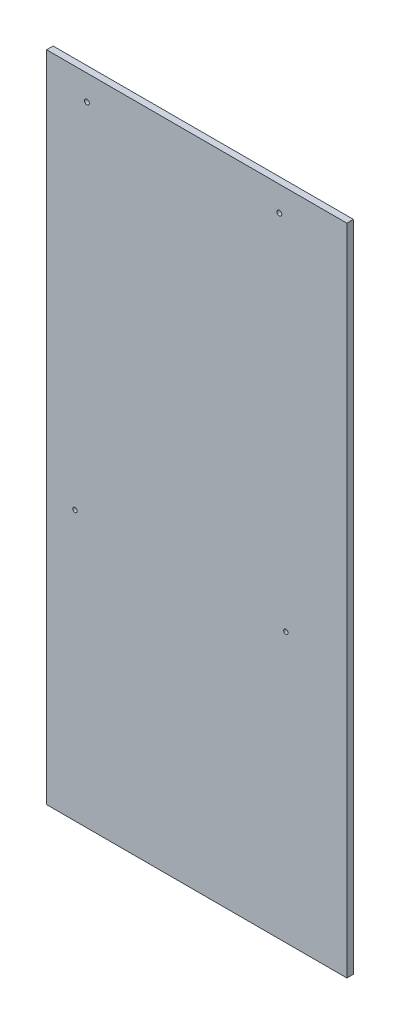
ISO-10303-21;
HEADER;
FILE_DESCRIPTION(('STEP AP214'),'2;1');
FILE_NAME('part.step','',(''),(''),'','','');
FILE_SCHEMA(('AUTOMOTIVE_DESIGN { 1 0 10303 214 1 1 1 1 }'));
ENDSEC;
DATA;
#1=APPLICATION_CONTEXT('core data for automotive mechanical design processes');
#2=APPLICATION_PROTOCOL_DEFINITION('international standard','automotive_design',2000,#1);
#3=PRODUCT_CONTEXT('',#1,'mechanical');
#4=PRODUCT('Part','Part','',(#3));
#5=PRODUCT_RELATED_PRODUCT_CATEGORY('part','',(#4));
#6=PRODUCT_DEFINITION_FORMATION('','',#4);
#7=PRODUCT_DEFINITION_CONTEXT('part definition',#1,'design');
#8=PRODUCT_DEFINITION('design','',#6,#7);
#9=PRODUCT_DEFINITION_SHAPE('','',#8);
#10=(LENGTH_UNIT() NAMED_UNIT(*) SI_UNIT(.MILLI.,.METRE.));
#11=(NAMED_UNIT(*) PLANE_ANGLE_UNIT() SI_UNIT($,.RADIAN.));
#12=(NAMED_UNIT(*) SI_UNIT($,.STERADIAN.) SOLID_ANGLE_UNIT());
#13=UNCERTAINTY_MEASURE_WITH_UNIT(LENGTH_MEASURE(1.E-05),#10,'distance_accuracy_value','');
#14=(GEOMETRIC_REPRESENTATION_CONTEXT(3) GLOBAL_UNCERTAINTY_ASSIGNED_CONTEXT((#13)) GLOBAL_UNIT_ASSIGNED_CONTEXT((#10,
#11,#12)) REPRESENTATION_CONTEXT('',''));
#15=CARTESIAN_POINT('',(0.,0.,0.));
#16=DIRECTION('',(0.,0.,1.));
#17=DIRECTION('',(1.,0.,0.));
#18=AXIS2_PLACEMENT_3D('',#15,#16,#17);
#19=CARTESIAN_POINT('',(175.006,-381.,7.62));
#20=DIRECTION('',(-1.,0.,0.));
#21=DIRECTION('',(0.,0.,1.));
#22=AXIS2_PLACEMENT_3D('',#19,#20,#21);
#23=PLANE('',#22);
#24=DIRECTION('',(0.,1.,0.));
#25=VECTOR('',#24,1.);
#26=CARTESIAN_POINT('',(175.006,-381.,0.));
#27=LINE('',#26,#25);
#28=CARTESIAN_POINT('',(175.006,-381.,0.));
#29=VERTEX_POINT('',#28);
#30=CARTESIAN_POINT('',(175.006,381.,0.));
#31=VERTEX_POINT('',#30);
#32=EDGE_CURVE('E107',#29,#31,#27,.T.);
#33=ORIENTED_EDGE('',*,*,#32,.T.);
#34=DIRECTION('',(0.,0.,-1.));
#35=VECTOR('',#34,1.);
#36=CARTESIAN_POINT('',(175.006,381.,7.62));
#37=LINE('',#36,#35);
#38=CARTESIAN_POINT('',(175.006,381.,7.62));
#39=VERTEX_POINT('',#38);
#40=EDGE_CURVE('E11',#39,#31,#37,.T.);
#41=ORIENTED_EDGE('',*,*,#40,.F.);
#42=DIRECTION('',(0.,1.,0.));
#43=VECTOR('',#42,1.);
#44=CARTESIAN_POINT('',(175.006,-381.,7.62));
#45=LINE('',#44,#43);
#46=CARTESIAN_POINT('',(175.006,-381.,7.62));
#47=VERTEX_POINT('',#46);
#48=EDGE_CURVE('E91',#47,#39,#45,.T.);
#49=ORIENTED_EDGE('',*,*,#48,.F.);
#50=DIRECTION('',(0.,0.,-1.));
#51=VECTOR('',#50,1.);
#52=CARTESIAN_POINT('',(175.006,-381.,7.62));
#53=LINE('',#52,#51);
#54=EDGE_CURVE('E103',#47,#29,#53,.T.);
#55=ORIENTED_EDGE('',*,*,#54,.T.);
#56=EDGE_LOOP('',(#33,#41,#49,#55));
#57=FACE_BOUND('',#56,.T.);
#58=ADVANCED_FACE('F39',(#57),#23,.F.);
#59=CARTESIAN_POINT('',(-175.006,381.,7.62));
#60=DIRECTION('',(0.,-1.,0.));
#61=DIRECTION('',(0.,0.,-1.));
#62=AXIS2_PLACEMENT_3D('',#59,#60,#61);
#63=PLANE('',#62);
#64=DIRECTION('',(-1.,0.,0.));
#65=VECTOR('',#64,1.);
#66=CARTESIAN_POINT('',(-175.006,381.,0.));
#67=LINE('',#66,#65);
#68=CARTESIAN_POINT('',(-175.006,381.,0.));
#69=VERTEX_POINT('',#68);
#70=EDGE_CURVE('E96',#31,#69,#67,.T.);
#71=ORIENTED_EDGE('',*,*,#70,.T.);
#72=DIRECTION('',(0.,0.,-1.));
#73=VECTOR('',#72,1.);
#74=CARTESIAN_POINT('',(-175.006,381.,7.62));
#75=LINE('',#74,#73);
#76=CARTESIAN_POINT('',(-175.006,381.,7.62));
#77=VERTEX_POINT('',#76);
#78=EDGE_CURVE('E48',#77,#69,#75,.T.);
#79=ORIENTED_EDGE('',*,*,#78,.F.);
#80=DIRECTION('',(-1.,0.,0.));
#81=VECTOR('',#80,1.);
#82=CARTESIAN_POINT('',(-175.006,381.,7.62));
#83=LINE('',#82,#81);
#84=EDGE_CURVE('E86',#39,#77,#83,.T.);
#85=ORIENTED_EDGE('',*,*,#84,.F.);
#86=ORIENTED_EDGE('',*,*,#40,.T.);
#87=EDGE_LOOP('',(#71,#79,#85,#86));
#88=FACE_BOUND('',#87,.T.);
#89=ADVANCED_FACE('F95',(#88),#63,.F.);
#90=CARTESIAN_POINT('',(-175.006,-381.,7.62));
#91=DIRECTION('',(1.,0.,0.));
#92=DIRECTION('',(0.,0.,-1.));
#93=AXIS2_PLACEMENT_3D('',#90,#91,#92);
#94=PLANE('',#93);
#95=DIRECTION('',(0.,-1.,0.));
#96=VECTOR('',#95,1.);
#97=CARTESIAN_POINT('',(-175.006,-381.,0.));
#98=LINE('',#97,#96);
#99=CARTESIAN_POINT('',(-175.006,-381.,0.));
#100=VERTEX_POINT('',#99);
#101=EDGE_CURVE('E73',#69,#100,#98,.T.);
#102=ORIENTED_EDGE('',*,*,#101,.T.);
#103=DIRECTION('',(0.,0.,-1.));
#104=VECTOR('',#103,1.);
#105=CARTESIAN_POINT('',(-175.006,-381.,7.62));
#106=LINE('',#105,#104);
#107=CARTESIAN_POINT('',(-175.006,-381.,7.62));
#108=VERTEX_POINT('',#107);
#109=EDGE_CURVE('E98',#108,#100,#106,.T.);
#110=ORIENTED_EDGE('',*,*,#109,.F.);
#111=DIRECTION('',(0.,-1.,0.));
#112=VECTOR('',#111,1.);
#113=CARTESIAN_POINT('',(-175.006,-381.,7.62));
#114=LINE('',#113,#112);
#115=EDGE_CURVE('E89',#77,#108,#114,.T.);
#116=ORIENTED_EDGE('',*,*,#115,.F.);
#117=ORIENTED_EDGE('',*,*,#78,.T.);
#118=EDGE_LOOP('',(#102,#110,#116,#117));
#119=FACE_BOUND('',#118,.T.);
#120=ADVANCED_FACE('F99',(#119),#94,.F.);
#121=CARTESIAN_POINT('',(-175.006,-381.,7.62));
#122=DIRECTION('',(0.,1.,0.));
#123=DIRECTION('',(0.,0.,1.));
#124=AXIS2_PLACEMENT_3D('',#121,#122,#123);
#125=PLANE('',#124);
#126=DIRECTION('',(1.,0.,0.));
#127=VECTOR('',#126,1.);
#128=CARTESIAN_POINT('',(-175.006,-381.,0.));
#129=LINE('',#128,#127);
#130=EDGE_CURVE('E79',#100,#29,#129,.T.);
#131=ORIENTED_EDGE('',*,*,#130,.T.);
#132=ORIENTED_EDGE('',*,*,#54,.F.);
#133=DIRECTION('',(1.,0.,0.));
#134=VECTOR('',#133,1.);
#135=CARTESIAN_POINT('',(-175.006,-381.,7.62));
#136=LINE('',#135,#134);
#137=EDGE_CURVE('E56',#108,#47,#136,.T.);
#138=ORIENTED_EDGE('',*,*,#137,.F.);
#139=ORIENTED_EDGE('',*,*,#109,.T.);
#140=EDGE_LOOP('',(#131,#132,#138,#139));
#141=FACE_BOUND('',#140,.T.);
#142=ADVANCED_FACE('F121',(#141),#125,.F.);
#143=CARTESIAN_POINT('',(0.,0.,7.62));
#144=DIRECTION('',(0.,0.,-1.));
#145=DIRECTION('',(-1.,0.,0.));
#146=AXIS2_PLACEMENT_3D('',#143,#144,#145);
#147=PLANE('',#146);
#148=CARTESIAN_POINT('',(103.886,-67.056,7.62));
#149=DIRECTION('',(0.,0.,1.));
#150=DIRECTION('',(1.,0.,0.));
#151=AXIS2_PLACEMENT_3D('',#148,#149,#150);
#152=CIRCLE('',#151,2.53999999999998);
#153=CARTESIAN_POINT('',(106.426,-67.056,7.62));
#154=VERTEX_POINT('',#153);
#155=EDGE_CURVE('E152',#154,#154,#152,.T.);
#156=ORIENTED_EDGE('',*,*,#155,.F.);
#157=EDGE_LOOP('',(#156));
#158=FACE_BOUND('',#157,.T.);
#159=CARTESIAN_POINT('',(-141.986,-67.056,7.62));
#160=DIRECTION('',(0.,0.,1.));
#161=DIRECTION('',(1.,0.,0.));
#162=AXIS2_PLACEMENT_3D('',#159,#160,#161);
#163=CIRCLE('',#162,2.53999999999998);
#164=CARTESIAN_POINT('',(-139.446,-67.056,7.62));
#165=VERTEX_POINT('',#164);
#166=EDGE_CURVE('E144',#165,#165,#163,.T.);
#167=ORIENTED_EDGE('',*,*,#166,.F.);
#168=EDGE_LOOP('',(#167));
#169=FACE_BOUND('',#168,.T.);
#170=CARTESIAN_POINT('',(-128.016,351.79,7.62));
#171=DIRECTION('',(0.,0.,1.));
#172=DIRECTION('',(1.,0.,0.));
#173=AXIS2_PLACEMENT_3D('',#170,#171,#172);
#174=CIRCLE('',#173,2.85750000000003);
#175=CARTESIAN_POINT('',(-125.1585,351.79,7.62));
#176=VERTEX_POINT('',#175);
#177=EDGE_CURVE('E137',#176,#176,#174,.T.);
#178=ORIENTED_EDGE('',*,*,#177,.F.);
#179=EDGE_LOOP('',(#178));
#180=FACE_BOUND('',#179,.T.);
#181=CARTESIAN_POINT('',(96.266,351.79,7.62));
#182=DIRECTION('',(0.,0.,1.));
#183=DIRECTION('',(1.,0.,0.));
#184=AXIS2_PLACEMENT_3D('',#181,#182,#183);
#185=CIRCLE('',#184,2.85750000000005);
#186=CARTESIAN_POINT('',(99.1235,351.79,7.62));
#187=VERTEX_POINT('',#186);
#188=EDGE_CURVE('E128',#187,#187,#185,.T.);
#189=ORIENTED_EDGE('',*,*,#188,.F.);
#190=EDGE_LOOP('',(#189));
#191=FACE_BOUND('',#190,.T.);
#192=ORIENTED_EDGE('',*,*,#48,.T.);
#193=ORIENTED_EDGE('',*,*,#84,.T.);
#194=ORIENTED_EDGE('',*,*,#115,.T.);
#195=ORIENTED_EDGE('',*,*,#137,.T.);
#196=EDGE_LOOP('',(#192,#193,#194,#195));
#197=FACE_BOUND('',#196,.T.);
#198=ADVANCED_FACE('F87',(#158,#169,#180,#191,#197),#147,.F.);
#199=CARTESIAN_POINT('',(0.,0.,0.));
#200=DIRECTION('',(0.,0.,-1.));
#201=DIRECTION('',(-1.,0.,0.));
#202=AXIS2_PLACEMENT_3D('',#199,#200,#201);
#203=PLANE('',#202);
#204=CARTESIAN_POINT('',(103.886,-67.056,0.));
#205=DIRECTION('',(0.,0.,1.));
#206=DIRECTION('',(1.,0.,0.));
#207=AXIS2_PLACEMENT_3D('',#204,#205,#206);
#208=CIRCLE('',#207,2.53999999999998);
#209=CARTESIAN_POINT('',(106.426,-67.056,0.));
#210=VERTEX_POINT('',#209);
#211=EDGE_CURVE('E148',#210,#210,#208,.T.);
#212=ORIENTED_EDGE('',*,*,#211,.T.);
#213=EDGE_LOOP('',(#212));
#214=FACE_BOUND('',#213,.T.);
#215=CARTESIAN_POINT('',(-141.986,-67.056,0.));
#216=DIRECTION('',(0.,0.,1.));
#217=DIRECTION('',(1.,0.,0.));
#218=AXIS2_PLACEMENT_3D('',#215,#216,#217);
#219=CIRCLE('',#218,2.53999999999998);
#220=CARTESIAN_POINT('',(-139.446,-67.056,0.));
#221=VERTEX_POINT('',#220);
#222=EDGE_CURVE('E133',#221,#221,#219,.T.);
#223=ORIENTED_EDGE('',*,*,#222,.T.);
#224=EDGE_LOOP('',(#223));
#225=FACE_BOUND('',#224,.T.);
#226=CARTESIAN_POINT('',(-128.016,351.79,0.));
#227=DIRECTION('',(0.,0.,1.));
#228=DIRECTION('',(1.,0.,0.));
#229=AXIS2_PLACEMENT_3D('',#226,#227,#228);
#230=CIRCLE('',#229,2.85750000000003);
#231=CARTESIAN_POINT('',(-125.1585,351.79,0.));
#232=VERTEX_POINT('',#231);
#233=EDGE_CURVE('E111',#232,#232,#230,.T.);
#234=ORIENTED_EDGE('',*,*,#233,.T.);
#235=EDGE_LOOP('',(#234));
#236=FACE_BOUND('',#235,.T.);
#237=CARTESIAN_POINT('',(96.266,351.79,0.));
#238=DIRECTION('',(0.,0.,1.));
#239=DIRECTION('',(1.,0.,0.));
#240=AXIS2_PLACEMENT_3D('',#237,#238,#239);
#241=CIRCLE('',#240,2.85750000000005);
#242=CARTESIAN_POINT('',(99.1235,351.79,0.));
#243=VERTEX_POINT('',#242);
#244=EDGE_CURVE('E132',#243,#243,#241,.T.);
#245=ORIENTED_EDGE('',*,*,#244,.T.);
#246=EDGE_LOOP('',(#245));
#247=FACE_BOUND('',#246,.T.);
#248=ORIENTED_EDGE('',*,*,#32,.F.);
#249=ORIENTED_EDGE('',*,*,#130,.F.);
#250=ORIENTED_EDGE('',*,*,#101,.F.);
#251=ORIENTED_EDGE('',*,*,#70,.F.);
#252=EDGE_LOOP('',(#248,#249,#250,#251));
#253=FACE_BOUND('',#252,.T.);
#254=ADVANCED_FACE('F124',(#214,#225,#236,#247,#253),#203,.T.);
#255=CARTESIAN_POINT('',(96.266,351.79,0.));
#256=DIRECTION('',(0.,0.,1.));
#257=DIRECTION('',(1.,0.,0.));
#258=AXIS2_PLACEMENT_3D('',#255,#256,#257);
#259=CYLINDRICAL_SURFACE('',#258,2.85750000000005);
#260=CARTESIAN_POINT('',(99.1235,351.79,0.));
#261=CARTESIAN_POINT('',(99.1235,351.79,0.0793749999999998));
#262=CARTESIAN_POINT('',(99.1235,351.79,0.15875));
#263=CARTESIAN_POINT('',(99.1235,351.79,0.3175));
#264=CARTESIAN_POINT('',(99.1235,351.79,0.396875));
#265=CARTESIAN_POINT('',(99.1235,351.79,0.555625));
#266=CARTESIAN_POINT('',(99.1235,351.79,0.635));
#267=CARTESIAN_POINT('',(99.1235,351.79,0.79375));
#268=CARTESIAN_POINT('',(99.1235,351.79,0.873125));
#269=CARTESIAN_POINT('',(99.1235,351.79,1.031875));
#270=CARTESIAN_POINT('',(99.1235,351.79,1.11125));
#271=CARTESIAN_POINT('',(99.1235,351.79,1.27));
#272=CARTESIAN_POINT('',(99.1235,351.79,1.349375));
#273=CARTESIAN_POINT('',(99.1235,351.79,1.508125));
#274=CARTESIAN_POINT('',(99.1235,351.79,1.5875));
#275=CARTESIAN_POINT('',(99.1235,351.79,1.74625));
#276=CARTESIAN_POINT('',(99.1235,351.79,1.825625));
#277=CARTESIAN_POINT('',(99.1235,351.79,1.984375));
#278=CARTESIAN_POINT('',(99.1235,351.79,2.06375));
#279=CARTESIAN_POINT('',(99.1235,351.79,2.2225));
#280=CARTESIAN_POINT('',(99.1235,351.79,2.301875));
#281=CARTESIAN_POINT('',(99.1235,351.79,2.460625));
#282=CARTESIAN_POINT('',(99.1235,351.79,2.54));
#283=CARTESIAN_POINT('',(99.1235,351.79,2.69875));
#284=CARTESIAN_POINT('',(99.1235,351.79,2.778125));
#285=CARTESIAN_POINT('',(99.1235,351.79,2.936875));
#286=CARTESIAN_POINT('',(99.1235,351.79,3.01625));
#287=CARTESIAN_POINT('',(99.1235,351.79,3.175));
#288=CARTESIAN_POINT('',(99.1235,351.79,3.254375));
#289=CARTESIAN_POINT('',(99.1235,351.79,3.413125));
#290=CARTESIAN_POINT('',(99.1235,351.79,3.4925));
#291=CARTESIAN_POINT('',(99.1235,351.79,3.65125));
#292=CARTESIAN_POINT('',(99.1235,351.79,3.730625));
#293=CARTESIAN_POINT('',(99.1235,351.79,3.889375));
#294=CARTESIAN_POINT('',(99.1235,351.79,3.96875));
#295=CARTESIAN_POINT('',(99.1235,351.79,4.1275));
#296=CARTESIAN_POINT('',(99.1235,351.79,4.206875));
#297=CARTESIAN_POINT('',(99.1235,351.79,4.365625));
#298=CARTESIAN_POINT('',(99.1235,351.79,4.445));
#299=CARTESIAN_POINT('',(99.1235,351.79,4.60375));
#300=CARTESIAN_POINT('',(99.1235,351.79,4.683125));
#301=CARTESIAN_POINT('',(99.1235,351.79,4.841875));
#302=CARTESIAN_POINT('',(99.1235,351.79,4.92125));
#303=CARTESIAN_POINT('',(99.1235,351.79,5.08));
#304=CARTESIAN_POINT('',(99.1235,351.79,5.159375));
#305=CARTESIAN_POINT('',(99.1235,351.79,5.318125));
#306=CARTESIAN_POINT('',(99.1235,351.79,5.3975));
#307=CARTESIAN_POINT('',(99.1235,351.79,5.55625));
#308=CARTESIAN_POINT('',(99.1235,351.79,5.635625));
#309=CARTESIAN_POINT('',(99.1235,351.79,5.794375));
#310=CARTESIAN_POINT('',(99.1235,351.79,5.87375));
#311=CARTESIAN_POINT('',(99.1235,351.79,6.0325));
#312=CARTESIAN_POINT('',(99.1235,351.79,6.111875));
#313=CARTESIAN_POINT('',(99.1235,351.79,6.270625));
#314=CARTESIAN_POINT('',(99.1235,351.79,6.35));
#315=CARTESIAN_POINT('',(99.1235,351.79,6.50875));
#316=CARTESIAN_POINT('',(99.1235,351.79,6.588125));
#317=CARTESIAN_POINT('',(99.1235,351.79,6.746875));
#318=CARTESIAN_POINT('',(99.1235,351.79,6.82625));
#319=CARTESIAN_POINT('',(99.1235,351.79,6.985));
#320=CARTESIAN_POINT('',(99.1235,351.79,7.064375));
#321=CARTESIAN_POINT('',(99.1235,351.79,7.223125));
#322=CARTESIAN_POINT('',(99.1235,351.79,7.3025));
#323=CARTESIAN_POINT('',(99.1235,351.79,7.46125));
#324=CARTESIAN_POINT('',(99.1235,351.79,7.540625));
#325=CARTESIAN_POINT('',(99.1235,351.79,7.62));
#326=B_SPLINE_CURVE_WITH_KNOTS('',3,(#260,#261,#262,#263,#264,#265,#266,#267,#268,#269,#270,
#271,#272,#273,#274,#275,#276,#277,#278,#279,#280,#281,#282,#283,#284,#285,#286,#287,#288,#289,
#290,#291,#292,#293,#294,#295,#296,#297,#298,#299,#300,#301,#302,#303,#304,#305,#306,#307,#308,
#309,#310,#311,#312,#313,#314,#315,#316,#317,#318,#319,#320,#321,#322,#323,#324,#325),
.UNSPECIFIED.,.F.,.F.,(4,2,2,2,2,2,2,2,2,2,2,2,2,2,2,2,2,2,2,2,2,2,2,2,2,2,2,2,2,2,2,2,4),(0.,
0.238125,0.47625,0.714375,0.9525,1.190625,1.42875,1.666875,1.905,2.143125,2.38125,2.619375,
2.8575,3.095625,3.33375,3.571875,3.81,4.048125,4.28625,4.524375,4.7625,5.000625,5.23875,
5.476875,5.715,5.953125,6.19125,6.429375,6.6675,6.905625,7.14375,7.381875,7.62),.UNSPECIFIED.);
#327=EDGE_CURVE('BSEAM178',#243,#187,#326,.T.);
#328=ORIENTED_EDGE('',*,*,#244,.F.);
#329=ORIENTED_EDGE('',*,*,#188,.T.);
#330=ORIENTED_EDGE('',*,*,#327,.T.);
#331=ORIENTED_EDGE('',*,*,#327,.F.);
#332=EDGE_LOOP('',(#328,#330,#329,#331));
#333=FACE_BOUND('',#332,.T.);
#334=ADVANCED_FACE('F178',(#333),#259,.F.);
#335=CARTESIAN_POINT('',(-128.016,351.79,0.));
#336=DIRECTION('',(0.,0.,1.));
#337=DIRECTION('',(1.,0.,0.));
#338=AXIS2_PLACEMENT_3D('',#335,#336,#337);
#339=CYLINDRICAL_SURFACE('',#338,2.85750000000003);
#340=CARTESIAN_POINT('',(-125.1585,351.79,0.));
#341=CARTESIAN_POINT('',(-125.1585,351.79,0.0793749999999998));
#342=CARTESIAN_POINT('',(-125.1585,351.79,0.15875));
#343=CARTESIAN_POINT('',(-125.1585,351.79,0.3175));
#344=CARTESIAN_POINT('',(-125.1585,351.79,0.396875));
#345=CARTESIAN_POINT('',(-125.1585,351.79,0.555625));
#346=CARTESIAN_POINT('',(-125.1585,351.79,0.635));
#347=CARTESIAN_POINT('',(-125.1585,351.79,0.79375));
#348=CARTESIAN_POINT('',(-125.1585,351.79,0.873125));
#349=CARTESIAN_POINT('',(-125.1585,351.79,1.031875));
#350=CARTESIAN_POINT('',(-125.1585,351.79,1.11125));
#351=CARTESIAN_POINT('',(-125.1585,351.79,1.27));
#352=CARTESIAN_POINT('',(-125.1585,351.79,1.349375));
#353=CARTESIAN_POINT('',(-125.1585,351.79,1.508125));
#354=CARTESIAN_POINT('',(-125.1585,351.79,1.5875));
#355=CARTESIAN_POINT('',(-125.1585,351.79,1.74625));
#356=CARTESIAN_POINT('',(-125.1585,351.79,1.825625));
#357=CARTESIAN_POINT('',(-125.1585,351.79,1.984375));
#358=CARTESIAN_POINT('',(-125.1585,351.79,2.06375));
#359=CARTESIAN_POINT('',(-125.1585,351.79,2.2225));
#360=CARTESIAN_POINT('',(-125.1585,351.79,2.301875));
#361=CARTESIAN_POINT('',(-125.1585,351.79,2.460625));
#362=CARTESIAN_POINT('',(-125.1585,351.79,2.54));
#363=CARTESIAN_POINT('',(-125.1585,351.79,2.69875));
#364=CARTESIAN_POINT('',(-125.1585,351.79,2.778125));
#365=CARTESIAN_POINT('',(-125.1585,351.79,2.936875));
#366=CARTESIAN_POINT('',(-125.1585,351.79,3.01625));
#367=CARTESIAN_POINT('',(-125.1585,351.79,3.175));
#368=CARTESIAN_POINT('',(-125.1585,351.79,3.254375));
#369=CARTESIAN_POINT('',(-125.1585,351.79,3.413125));
#370=CARTESIAN_POINT('',(-125.1585,351.79,3.4925));
#371=CARTESIAN_POINT('',(-125.1585,351.79,3.65125));
#372=CARTESIAN_POINT('',(-125.1585,351.79,3.730625));
#373=CARTESIAN_POINT('',(-125.1585,351.79,3.889375));
#374=CARTESIAN_POINT('',(-125.1585,351.79,3.96875));
#375=CARTESIAN_POINT('',(-125.1585,351.79,4.1275));
#376=CARTESIAN_POINT('',(-125.1585,351.79,4.206875));
#377=CARTESIAN_POINT('',(-125.1585,351.79,4.365625));
#378=CARTESIAN_POINT('',(-125.1585,351.79,4.445));
#379=CARTESIAN_POINT('',(-125.1585,351.79,4.60375));
#380=CARTESIAN_POINT('',(-125.1585,351.79,4.683125));
#381=CARTESIAN_POINT('',(-125.1585,351.79,4.841875));
#382=CARTESIAN_POINT('',(-125.1585,351.79,4.92125));
#383=CARTESIAN_POINT('',(-125.1585,351.79,5.08));
#384=CARTESIAN_POINT('',(-125.1585,351.79,5.159375));
#385=CARTESIAN_POINT('',(-125.1585,351.79,5.318125));
#386=CARTESIAN_POINT('',(-125.1585,351.79,5.3975));
#387=CARTESIAN_POINT('',(-125.1585,351.79,5.55625));
#388=CARTESIAN_POINT('',(-125.1585,351.79,5.635625));
#389=CARTESIAN_POINT('',(-125.1585,351.79,5.794375));
#390=CARTESIAN_POINT('',(-125.1585,351.79,5.87375));
#391=CARTESIAN_POINT('',(-125.1585,351.79,6.0325));
#392=CARTESIAN_POINT('',(-125.1585,351.79,6.111875));
#393=CARTESIAN_POINT('',(-125.1585,351.79,6.270625));
#394=CARTESIAN_POINT('',(-125.1585,351.79,6.35));
#395=CARTESIAN_POINT('',(-125.1585,351.79,6.50875));
#396=CARTESIAN_POINT('',(-125.1585,351.79,6.588125));
#397=CARTESIAN_POINT('',(-125.1585,351.79,6.746875));
#398=CARTESIAN_POINT('',(-125.1585,351.79,6.82625));
#399=CARTESIAN_POINT('',(-125.1585,351.79,6.985));
#400=CARTESIAN_POINT('',(-125.1585,351.79,7.064375));
#401=CARTESIAN_POINT('',(-125.1585,351.79,7.223125));
#402=CARTESIAN_POINT('',(-125.1585,351.79,7.3025));
#403=CARTESIAN_POINT('',(-125.1585,351.79,7.46125));
#404=CARTESIAN_POINT('',(-125.1585,351.79,7.540625));
#405=CARTESIAN_POINT('',(-125.1585,351.79,7.62));
#406=B_SPLINE_CURVE_WITH_KNOTS('',3,(#340,#341,#342,#343,#344,#345,#346,#347,#348,#349,#350,
#351,#352,#353,#354,#355,#356,#357,#358,#359,#360,#361,#362,#363,#364,#365,#366,#367,#368,#369,
#370,#371,#372,#373,#374,#375,#376,#377,#378,#379,#380,#381,#382,#383,#384,#385,#386,#387,#388,
#389,#390,#391,#392,#393,#394,#395,#396,#397,#398,#399,#400,#401,#402,#403,#404,#405),
.UNSPECIFIED.,.F.,.F.,(4,2,2,2,2,2,2,2,2,2,2,2,2,2,2,2,2,2,2,2,2,2,2,2,2,2,2,2,2,2,2,2,4),(0.,
0.238125,0.47625,0.714375,0.9525,1.190625,1.42875,1.666875,1.905,2.143125,2.38125,2.619375,
2.8575,3.095625,3.33375,3.571875,3.81,4.048125,4.28625,4.524375,4.7625,5.000625,5.23875,
5.476875,5.715,5.953125,6.19125,6.429375,6.6675,6.905625,7.14375,7.381875,7.62),.UNSPECIFIED.);
#407=EDGE_CURVE('BSEAM180',#232,#176,#406,.T.);
#408=ORIENTED_EDGE('',*,*,#233,.F.);
#409=ORIENTED_EDGE('',*,*,#177,.T.);
#410=ORIENTED_EDGE('',*,*,#407,.T.);
#411=ORIENTED_EDGE('',*,*,#407,.F.);
#412=EDGE_LOOP('',(#408,#410,#409,#411));
#413=FACE_BOUND('',#412,.T.);
#414=ADVANCED_FACE('F180',(#413),#339,.F.);
#415=CARTESIAN_POINT('',(-141.986,-67.056,0.));
#416=DIRECTION('',(0.,0.,1.));
#417=DIRECTION('',(1.,0.,0.));
#418=AXIS2_PLACEMENT_3D('',#415,#416,#417);
#419=CYLINDRICAL_SURFACE('',#418,2.53999999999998);
#420=CARTESIAN_POINT('',(-139.446,-67.056,0.));
#421=CARTESIAN_POINT('',(-139.446,-67.056,0.0793749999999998));
#422=CARTESIAN_POINT('',(-139.446,-67.056,0.15875));
#423=CARTESIAN_POINT('',(-139.446,-67.056,0.3175));
#424=CARTESIAN_POINT('',(-139.446,-67.056,0.396875));
#425=CARTESIAN_POINT('',(-139.446,-67.056,0.555625));
#426=CARTESIAN_POINT('',(-139.446,-67.056,0.635));
#427=CARTESIAN_POINT('',(-139.446,-67.056,0.79375));
#428=CARTESIAN_POINT('',(-139.446,-67.056,0.873125));
#429=CARTESIAN_POINT('',(-139.446,-67.056,1.031875));
#430=CARTESIAN_POINT('',(-139.446,-67.056,1.11125));
#431=CARTESIAN_POINT('',(-139.446,-67.056,1.27));
#432=CARTESIAN_POINT('',(-139.446,-67.056,1.349375));
#433=CARTESIAN_POINT('',(-139.446,-67.056,1.508125));
#434=CARTESIAN_POINT('',(-139.446,-67.056,1.5875));
#435=CARTESIAN_POINT('',(-139.446,-67.056,1.74625));
#436=CARTESIAN_POINT('',(-139.446,-67.056,1.825625));
#437=CARTESIAN_POINT('',(-139.446,-67.056,1.984375));
#438=CARTESIAN_POINT('',(-139.446,-67.056,2.06375));
#439=CARTESIAN_POINT('',(-139.446,-67.056,2.2225));
#440=CARTESIAN_POINT('',(-139.446,-67.056,2.301875));
#441=CARTESIAN_POINT('',(-139.446,-67.056,2.460625));
#442=CARTESIAN_POINT('',(-139.446,-67.056,2.54));
#443=CARTESIAN_POINT('',(-139.446,-67.056,2.69875));
#444=CARTESIAN_POINT('',(-139.446,-67.056,2.778125));
#445=CARTESIAN_POINT('',(-139.446,-67.056,2.936875));
#446=CARTESIAN_POINT('',(-139.446,-67.056,3.01625));
#447=CARTESIAN_POINT('',(-139.446,-67.056,3.175));
#448=CARTESIAN_POINT('',(-139.446,-67.056,3.254375));
#449=CARTESIAN_POINT('',(-139.446,-67.056,3.413125));
#450=CARTESIAN_POINT('',(-139.446,-67.056,3.4925));
#451=CARTESIAN_POINT('',(-139.446,-67.056,3.65125));
#452=CARTESIAN_POINT('',(-139.446,-67.056,3.730625));
#453=CARTESIAN_POINT('',(-139.446,-67.056,3.889375));
#454=CARTESIAN_POINT('',(-139.446,-67.056,3.96875));
#455=CARTESIAN_POINT('',(-139.446,-67.056,4.1275));
#456=CARTESIAN_POINT('',(-139.446,-67.056,4.206875));
#457=CARTESIAN_POINT('',(-139.446,-67.056,4.365625));
#458=CARTESIAN_POINT('',(-139.446,-67.056,4.445));
#459=CARTESIAN_POINT('',(-139.446,-67.056,4.60375));
#460=CARTESIAN_POINT('',(-139.446,-67.056,4.683125));
#461=CARTESIAN_POINT('',(-139.446,-67.056,4.841875));
#462=CARTESIAN_POINT('',(-139.446,-67.056,4.92125));
#463=CARTESIAN_POINT('',(-139.446,-67.056,5.08));
#464=CARTESIAN_POINT('',(-139.446,-67.056,5.159375));
#465=CARTESIAN_POINT('',(-139.446,-67.056,5.318125));
#466=CARTESIAN_POINT('',(-139.446,-67.056,5.3975));
#467=CARTESIAN_POINT('',(-139.446,-67.056,5.55625));
#468=CARTESIAN_POINT('',(-139.446,-67.056,5.635625));
#469=CARTESIAN_POINT('',(-139.446,-67.056,5.794375));
#470=CARTESIAN_POINT('',(-139.446,-67.056,5.87375));
#471=CARTESIAN_POINT('',(-139.446,-67.056,6.0325));
#472=CARTESIAN_POINT('',(-139.446,-67.056,6.111875));
#473=CARTESIAN_POINT('',(-139.446,-67.056,6.270625));
#474=CARTESIAN_POINT('',(-139.446,-67.056,6.35));
#475=CARTESIAN_POINT('',(-139.446,-67.056,6.50875));
#476=CARTESIAN_POINT('',(-139.446,-67.056,6.588125));
#477=CARTESIAN_POINT('',(-139.446,-67.056,6.746875));
#478=CARTESIAN_POINT('',(-139.446,-67.056,6.82625));
#479=CARTESIAN_POINT('',(-139.446,-67.056,6.985));
#480=CARTESIAN_POINT('',(-139.446,-67.056,7.064375));
#481=CARTESIAN_POINT('',(-139.446,-67.056,7.223125));
#482=CARTESIAN_POINT('',(-139.446,-67.056,7.3025));
#483=CARTESIAN_POINT('',(-139.446,-67.056,7.46125));
#484=CARTESIAN_POINT('',(-139.446,-67.056,7.540625));
#485=CARTESIAN_POINT('',(-139.446,-67.056,7.62));
#486=B_SPLINE_CURVE_WITH_KNOTS('',3,(#420,#421,#422,#423,#424,#425,#426,#427,#428,#429,#430,
#431,#432,#433,#434,#435,#436,#437,#438,#439,#440,#441,#442,#443,#444,#445,#446,#447,#448,#449,
#450,#451,#452,#453,#454,#455,#456,#457,#458,#459,#460,#461,#462,#463,#464,#465,#466,#467,#468,
#469,#470,#471,#472,#473,#474,#475,#476,#477,#478,#479,#480,#481,#482,#483,#484,#485),
.UNSPECIFIED.,.F.,.F.,(4,2,2,2,2,2,2,2,2,2,2,2,2,2,2,2,2,2,2,2,2,2,2,2,2,2,2,2,2,2,2,2,4),(0.,
0.238125,0.47625,0.714375,0.9525,1.190625,1.42875,1.666875,1.905,2.143125,2.38125,2.619375,
2.8575,3.095625,3.33375,3.571875,3.81,4.048125,4.28625,4.524375,4.7625,5.000625,5.23875,
5.476875,5.715,5.953125,6.19125,6.429375,6.6675,6.905625,7.14375,7.381875,7.62),.UNSPECIFIED.);
#487=EDGE_CURVE('BSEAM165',#221,#165,#486,.T.);
#488=ORIENTED_EDGE('',*,*,#222,.F.);
#489=ORIENTED_EDGE('',*,*,#166,.T.);
#490=ORIENTED_EDGE('',*,*,#487,.T.);
#491=ORIENTED_EDGE('',*,*,#487,.F.);
#492=EDGE_LOOP('',(#488,#490,#489,#491));
#493=FACE_BOUND('',#492,.T.);
#494=ADVANCED_FACE('F165',(#493),#419,.F.);
#495=CARTESIAN_POINT('',(103.886,-67.056,0.));
#496=DIRECTION('',(0.,0.,1.));
#497=DIRECTION('',(1.,0.,0.));
#498=AXIS2_PLACEMENT_3D('',#495,#496,#497);
#499=CYLINDRICAL_SURFACE('',#498,2.53999999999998);
#500=CARTESIAN_POINT('',(106.426,-67.056,0.));
#501=CARTESIAN_POINT('',(106.426,-67.056,0.0793749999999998));
#502=CARTESIAN_POINT('',(106.426,-67.056,0.15875));
#503=CARTESIAN_POINT('',(106.426,-67.056,0.3175));
#504=CARTESIAN_POINT('',(106.426,-67.056,0.396875));
#505=CARTESIAN_POINT('',(106.426,-67.056,0.555625));
#506=CARTESIAN_POINT('',(106.426,-67.056,0.635));
#507=CARTESIAN_POINT('',(106.426,-67.056,0.79375));
#508=CARTESIAN_POINT('',(106.426,-67.056,0.873125));
#509=CARTESIAN_POINT('',(106.426,-67.056,1.031875));
#510=CARTESIAN_POINT('',(106.426,-67.056,1.11125));
#511=CARTESIAN_POINT('',(106.426,-67.056,1.27));
#512=CARTESIAN_POINT('',(106.426,-67.056,1.349375));
#513=CARTESIAN_POINT('',(106.426,-67.056,1.508125));
#514=CARTESIAN_POINT('',(106.426,-67.056,1.5875));
#515=CARTESIAN_POINT('',(106.426,-67.056,1.74625));
#516=CARTESIAN_POINT('',(106.426,-67.056,1.825625));
#517=CARTESIAN_POINT('',(106.426,-67.056,1.984375));
#518=CARTESIAN_POINT('',(106.426,-67.056,2.06375));
#519=CARTESIAN_POINT('',(106.426,-67.056,2.2225));
#520=CARTESIAN_POINT('',(106.426,-67.056,2.301875));
#521=CARTESIAN_POINT('',(106.426,-67.056,2.460625));
#522=CARTESIAN_POINT('',(106.426,-67.056,2.54));
#523=CARTESIAN_POINT('',(106.426,-67.056,2.69875));
#524=CARTESIAN_POINT('',(106.426,-67.056,2.778125));
#525=CARTESIAN_POINT('',(106.426,-67.056,2.936875));
#526=CARTESIAN_POINT('',(106.426,-67.056,3.01625));
#527=CARTESIAN_POINT('',(106.426,-67.056,3.175));
#528=CARTESIAN_POINT('',(106.426,-67.056,3.254375));
#529=CARTESIAN_POINT('',(106.426,-67.056,3.413125));
#530=CARTESIAN_POINT('',(106.426,-67.056,3.4925));
#531=CARTESIAN_POINT('',(106.426,-67.056,3.65125));
#532=CARTESIAN_POINT('',(106.426,-67.056,3.730625));
#533=CARTESIAN_POINT('',(106.426,-67.056,3.889375));
#534=CARTESIAN_POINT('',(106.426,-67.056,3.96875));
#535=CARTESIAN_POINT('',(106.426,-67.056,4.1275));
#536=CARTESIAN_POINT('',(106.426,-67.056,4.206875));
#537=CARTESIAN_POINT('',(106.426,-67.056,4.365625));
#538=CARTESIAN_POINT('',(106.426,-67.056,4.445));
#539=CARTESIAN_POINT('',(106.426,-67.056,4.60375));
#540=CARTESIAN_POINT('',(106.426,-67.056,4.683125));
#541=CARTESIAN_POINT('',(106.426,-67.056,4.841875));
#542=CARTESIAN_POINT('',(106.426,-67.056,4.92125));
#543=CARTESIAN_POINT('',(106.426,-67.056,5.08));
#544=CARTESIAN_POINT('',(106.426,-67.056,5.159375));
#545=CARTESIAN_POINT('',(106.426,-67.056,5.318125));
#546=CARTESIAN_POINT('',(106.426,-67.056,5.3975));
#547=CARTESIAN_POINT('',(106.426,-67.056,5.55625));
#548=CARTESIAN_POINT('',(106.426,-67.056,5.635625));
#549=CARTESIAN_POINT('',(106.426,-67.056,5.794375));
#550=CARTESIAN_POINT('',(106.426,-67.056,5.87375));
#551=CARTESIAN_POINT('',(106.426,-67.056,6.0325));
#552=CARTESIAN_POINT('',(106.426,-67.056,6.111875));
#553=CARTESIAN_POINT('',(106.426,-67.056,6.270625));
#554=CARTESIAN_POINT('',(106.426,-67.056,6.35));
#555=CARTESIAN_POINT('',(106.426,-67.056,6.50875));
#556=CARTESIAN_POINT('',(106.426,-67.056,6.588125));
#557=CARTESIAN_POINT('',(106.426,-67.056,6.746875));
#558=CARTESIAN_POINT('',(106.426,-67.056,6.82625));
#559=CARTESIAN_POINT('',(106.426,-67.056,6.985));
#560=CARTESIAN_POINT('',(106.426,-67.056,7.064375));
#561=CARTESIAN_POINT('',(106.426,-67.056,7.223125));
#562=CARTESIAN_POINT('',(106.426,-67.056,7.3025));
#563=CARTESIAN_POINT('',(106.426,-67.056,7.46125));
#564=CARTESIAN_POINT('',(106.426,-67.056,7.540625));
#565=CARTESIAN_POINT('',(106.426,-67.056,7.62));
#566=B_SPLINE_CURVE_WITH_KNOTS('',3,(#500,#501,#502,#503,#504,#505,#506,#507,#508,#509,#510,
#511,#512,#513,#514,#515,#516,#517,#518,#519,#520,#521,#522,#523,#524,#525,#526,#527,#528,#529,
#530,#531,#532,#533,#534,#535,#536,#537,#538,#539,#540,#541,#542,#543,#544,#545,#546,#547,#548,
#549,#550,#551,#552,#553,#554,#555,#556,#557,#558,#559,#560,#561,#562,#563,#564,#565),
.UNSPECIFIED.,.F.,.F.,(4,2,2,2,2,2,2,2,2,2,2,2,2,2,2,2,2,2,2,2,2,2,2,2,2,2,2,2,2,2,2,2,4),(0.,
0.238125,0.47625,0.714375,0.9525,1.190625,1.42875,1.666875,1.905,2.143125,2.38125,2.619375,
2.8575,3.095625,3.33375,3.571875,3.81,4.048125,4.28625,4.524375,4.7625,5.000625,5.23875,
5.476875,5.715,5.953125,6.19125,6.429375,6.6675,6.905625,7.14375,7.381875,7.62),.UNSPECIFIED.);
#567=EDGE_CURVE('BSEAM162',#210,#154,#566,.T.);
#568=ORIENTED_EDGE('',*,*,#211,.F.);
#569=ORIENTED_EDGE('',*,*,#155,.T.);
#570=ORIENTED_EDGE('',*,*,#567,.T.);
#571=ORIENTED_EDGE('',*,*,#567,.F.);
#572=EDGE_LOOP('',(#568,#570,#569,#571));
#573=FACE_BOUND('',#572,.T.);
#574=ADVANCED_FACE('F162',(#573),#499,.F.);
#575=CLOSED_SHELL('',(#58,#89,#120,#142,#198,#254,#334,#414,#494,#574));
#576=MANIFOLD_SOLID_BREP('B2',#575);
#577=ADVANCED_BREP_SHAPE_REPRESENTATION('',(#18,#576),#14);
#578=SHAPE_DEFINITION_REPRESENTATION(#9,#577);
ENDSEC;
END-ISO-10303-21;
